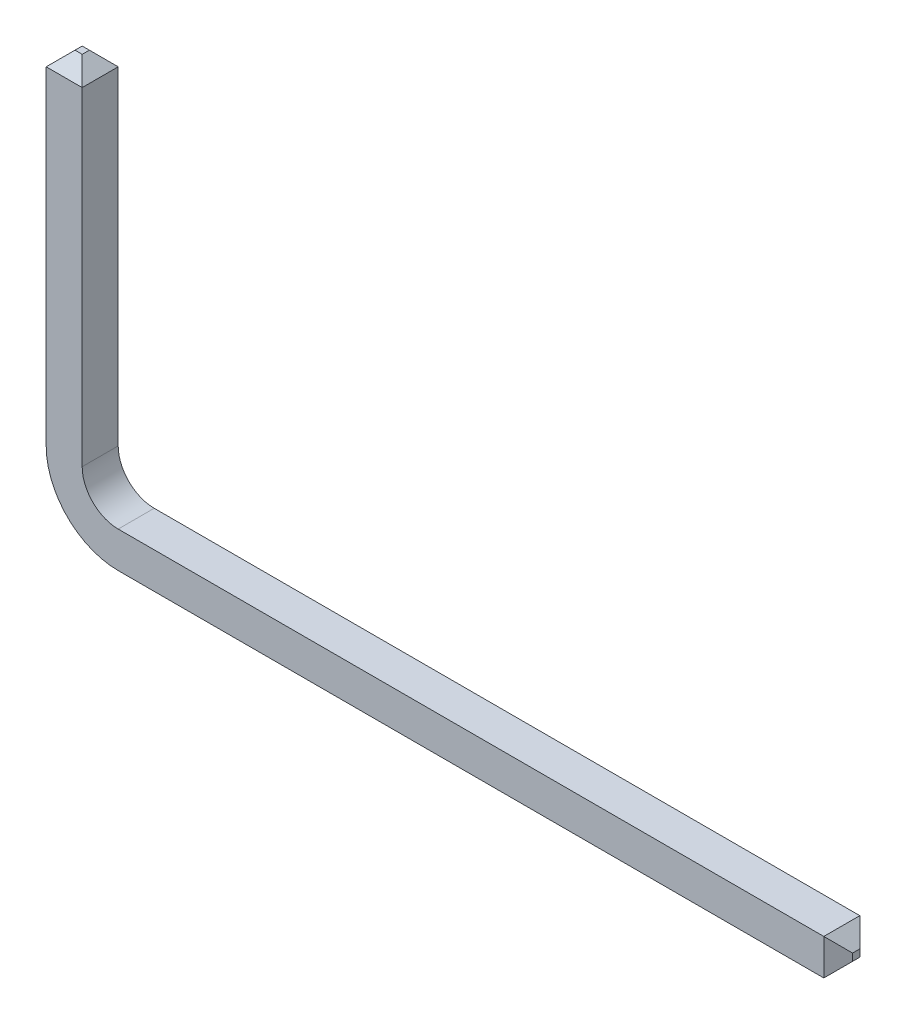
ISO-10303-21;
HEADER;
FILE_DESCRIPTION(('STEP AP214'),'2;1');
FILE_NAME('part.step','',(''),(''),'','','');
FILE_SCHEMA(('AUTOMOTIVE_DESIGN { 1 0 10303 214 1 1 1 1 }'));
ENDSEC;
DATA;
#1=APPLICATION_CONTEXT('core data for automotive mechanical design processes');
#2=APPLICATION_PROTOCOL_DEFINITION('international standard','automotive_design',2000,#1);
#3=PRODUCT_CONTEXT('',#1,'mechanical');
#4=PRODUCT('Part','Part','',(#3));
#5=PRODUCT_RELATED_PRODUCT_CATEGORY('part','',(#4));
#6=PRODUCT_DEFINITION_FORMATION('','',#4);
#7=PRODUCT_DEFINITION_CONTEXT('part definition',#1,'design');
#8=PRODUCT_DEFINITION('design','',#6,#7);
#9=PRODUCT_DEFINITION_SHAPE('','',#8);
#10=(LENGTH_UNIT() NAMED_UNIT(*) SI_UNIT(.MILLI.,.METRE.));
#11=(NAMED_UNIT(*) PLANE_ANGLE_UNIT() SI_UNIT($,.RADIAN.));
#12=(NAMED_UNIT(*) SI_UNIT($,.STERADIAN.) SOLID_ANGLE_UNIT());
#13=UNCERTAINTY_MEASURE_WITH_UNIT(LENGTH_MEASURE(1.E-05),#10,'distance_accuracy_value','');
#14=(GEOMETRIC_REPRESENTATION_CONTEXT(3) GLOBAL_UNCERTAINTY_ASSIGNED_CONTEXT((#13)) GLOBAL_UNIT_ASSIGNED_CONTEXT((#10,
#11,#12)) REPRESENTATION_CONTEXT('',''));
#15=CARTESIAN_POINT('',(0.,0.,0.));
#16=DIRECTION('',(0.,0.,1.));
#17=DIRECTION('',(1.,0.,0.));
#18=AXIS2_PLACEMENT_3D('',#15,#16,#17);
#19=CARTESIAN_POINT('',(1.45985415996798,2.96,0.1));
#20=DIRECTION('',(0.,0.707106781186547,-0.707106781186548));
#21=DIRECTION('',(0.,0.707106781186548,0.707106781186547));
#22=AXIS2_PLACEMENT_3D('',#19,#20,#21);
#23=PLANE('',#22);
#24=DIRECTION('',(1.,0.,0.));
#25=VECTOR('',#24,1.);
#26=CARTESIAN_POINT('',(-0.50414928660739,3.06,0.2));
#27=LINE('',#26,#25);
#28=CARTESIAN_POINT('',(-0.204149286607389,3.06,0.2));
#29=VERTEX_POINT('',#28);
#30=CARTESIAN_POINT('',(-0.30414928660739,3.06,0.2));
#31=VERTEX_POINT('',#30);
#32=EDGE_CURVE('E103',#29,#31,#27,.F.);
#33=ORIENTED_EDGE('',*,*,#32,.F.);
#34=DIRECTION('',(-0.577350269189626,0.577350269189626,0.577350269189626));
#35=VECTOR('',#34,1.);
#36=CARTESIAN_POINT('',(-0.00414928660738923,2.86,0.));
#37=LINE('',#36,#35);
#38=CARTESIAN_POINT('',(-0.00414928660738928,2.86,0.));
#39=VERTEX_POINT('',#38);
#40=EDGE_CURVE('E74',#39,#29,#37,.T.);
#41=ORIENTED_EDGE('',*,*,#40,.F.);
#42=DIRECTION('',(1.,0.,0.));
#43=VECTOR('',#42,1.);
#44=CARTESIAN_POINT('',(3.42385760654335,2.86,0.));
#45=LINE('',#44,#43);
#46=CARTESIAN_POINT('',(-0.504149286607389,2.86,0.));
#47=VERTEX_POINT('',#46);
#48=EDGE_CURVE('E203',#39,#47,#45,.F.);
#49=ORIENTED_EDGE('',*,*,#48,.T.);
#50=DIRECTION('',(-0.577350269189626,-0.577350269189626,-0.577350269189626));
#51=VECTOR('',#50,1.);
#52=CARTESIAN_POINT('',(-0.30414928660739,3.06,0.2));
#53=LINE('',#52,#51);
#54=EDGE_CURVE('E126',#31,#47,#53,.T.);
#55=ORIENTED_EDGE('',*,*,#54,.F.);
#56=EDGE_LOOP('',(#33,#41,#49,#55));
#57=FACE_BOUND('',#56,.T.);
#58=ADVANCED_FACE('F16',(#57),#23,.T.);
#59=CARTESIAN_POINT('',(10.3958507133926,-1.82164992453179,0.1));
#60=DIRECTION('',(0.707106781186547,0.,-0.707106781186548));
#61=DIRECTION('',(-0.707106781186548,0.,-0.707106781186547));
#62=AXIS2_PLACEMENT_3D('',#59,#60,#61);
#63=PLANE('',#62);
#64=DIRECTION('',(0.,1.,0.));
#65=VECTOR('',#64,1.);
#66=CARTESIAN_POINT('',(10.4958507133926,-2.2,0.2));
#67=LINE('',#66,#65);
#68=CARTESIAN_POINT('',(10.4958507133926,-2.5,0.2));
#69=VERTEX_POINT('',#68);
#70=CARTESIAN_POINT('',(10.4958507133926,-2.4,0.2));
#71=VERTEX_POINT('',#70);
#72=EDGE_CURVE('E94',#69,#71,#67,.T.);
#73=ORIENTED_EDGE('',*,*,#72,.F.);
#74=DIRECTION('',(0.577350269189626,0.577350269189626,0.577350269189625));
#75=VECTOR('',#74,1.);
#76=CARTESIAN_POINT('',(10.2958507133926,-2.7,0.));
#77=LINE('',#76,#75);
#78=CARTESIAN_POINT('',(10.2958507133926,-2.7,0.));
#79=VERTEX_POINT('',#78);
#80=EDGE_CURVE('E206',#79,#69,#77,.T.);
#81=ORIENTED_EDGE('',*,*,#80,.F.);
#82=DIRECTION('',(0.,1.,0.));
#83=VECTOR('',#82,1.);
#84=CARTESIAN_POINT('',(10.2958507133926,-1.44329984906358,0.));
#85=LINE('',#84,#83);
#86=CARTESIAN_POINT('',(10.2958507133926,-2.2,0.));
#87=VERTEX_POINT('',#86);
#88=EDGE_CURVE('E189',#79,#87,#85,.T.);
#89=ORIENTED_EDGE('',*,*,#88,.T.);
#90=DIRECTION('',(-0.577350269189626,0.577350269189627,-0.577350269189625));
#91=VECTOR('',#90,1.);
#92=CARTESIAN_POINT('',(10.4958507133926,-2.4,0.2));
#93=LINE('',#92,#91);
#94=EDGE_CURVE('E237',#71,#87,#93,.T.);
#95=ORIENTED_EDGE('',*,*,#94,.F.);
#96=EDGE_LOOP('',(#73,#81,#89,#95));
#97=FACE_BOUND('',#96,.T.);
#98=ADVANCED_FACE('F352',(#97),#63,.T.);
#99=CARTESIAN_POINT('',(10.4958507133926,-2.2,0.));
#100=DIRECTION('',(1.,0.,0.));
#101=DIRECTION('',(0.,0.,-1.));
#102=AXIS2_PLACEMENT_3D('',#99,#100,#101);
#103=PLANE('',#102);
#104=DIRECTION('',(0.,1.,0.));
#105=VECTOR('',#104,1.);
#106=CARTESIAN_POINT('',(10.4958507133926,-1.82164992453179,0.300000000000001));
#107=LINE('',#106,#105);
#108=CARTESIAN_POINT('',(10.4958507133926,-2.5,0.3));
#109=VERTEX_POINT('',#108);
#110=CARTESIAN_POINT('',(10.4958507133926,-2.4,0.3));
#111=VERTEX_POINT('',#110);
#112=EDGE_CURVE('E188',#109,#111,#107,.T.);
#113=ORIENTED_EDGE('',*,*,#112,.F.);
#114=DIRECTION('',(0.,0.,1.));
#115=VECTOR('',#114,1.);
#116=CARTESIAN_POINT('',(10.4958507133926,-2.5,0.));
#117=LINE('',#116,#115);
#118=EDGE_CURVE('E209',#69,#109,#117,.T.);
#119=ORIENTED_EDGE('',*,*,#118,.F.);
#120=ORIENTED_EDGE('',*,*,#72,.T.);
#121=DIRECTION('',(0.,0.,1.));
#122=VECTOR('',#121,1.);
#123=CARTESIAN_POINT('',(10.4958507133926,-2.4,0.));
#124=LINE('',#123,#122);
#125=EDGE_CURVE('E246',#111,#71,#124,.F.);
#126=ORIENTED_EDGE('',*,*,#125,.F.);
#127=EDGE_LOOP('',(#113,#119,#120,#126));
#128=FACE_BOUND('',#127,.T.);
#129=ADVANCED_FACE('F357',(#128),#103,.T.);
#130=CARTESIAN_POINT('',(10.3958507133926,-2.3,0.));
#131=DIRECTION('',(0.707106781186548,0.707106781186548,0.));
#132=DIRECTION('',(-0.707106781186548,0.707106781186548,0.));
#133=AXIS2_PLACEMENT_3D('',#130,#131,#132);
#134=PLANE('',#133);
#135=ORIENTED_EDGE('',*,*,#125,.T.);
#136=ORIENTED_EDGE('',*,*,#94,.T.);
#137=DIRECTION('',(0.,0.,1.));
#138=VECTOR('',#137,1.);
#139=CARTESIAN_POINT('',(10.2958507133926,-2.2,0.));
#140=LINE('',#139,#138);
#141=CARTESIAN_POINT('',(10.2958507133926,-2.2,0.5));
#142=VERTEX_POINT('',#141);
#143=EDGE_CURVE('E178',#142,#87,#140,.F.);
#144=ORIENTED_EDGE('',*,*,#143,.F.);
#145=DIRECTION('',(-0.577350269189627,0.577350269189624,0.577350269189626));
#146=VECTOR('',#145,1.);
#147=CARTESIAN_POINT('',(10.4958507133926,-2.4,0.300000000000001));
#148=LINE('',#147,#146);
#149=EDGE_CURVE('E182',#111,#142,#148,.T.);
#150=ORIENTED_EDGE('',*,*,#149,.F.);
#151=EDGE_LOOP('',(#135,#136,#144,#150));
#152=FACE_BOUND('',#151,.T.);
#153=ADVANCED_FACE('F316',(#152),#134,.T.);
#154=CARTESIAN_POINT('',(-0.104149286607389,2.96,0.));
#155=DIRECTION('',(0.707106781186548,0.707106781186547,0.));
#156=DIRECTION('',(-0.707106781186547,0.707106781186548,0.));
#157=AXIS2_PLACEMENT_3D('',#154,#155,#156);
#158=PLANE('',#157);
#159=DIRECTION('',(0.,0.,-1.));
#160=VECTOR('',#159,1.);
#161=CARTESIAN_POINT('',(-0.004149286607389,2.86,0.));
#162=LINE('',#161,#160);
#163=CARTESIAN_POINT('',(-0.00414928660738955,2.86,0.5));
#164=VERTEX_POINT('',#163);
#165=EDGE_CURVE('E171',#39,#164,#162,.F.);
#166=ORIENTED_EDGE('',*,*,#165,.F.);
#167=ORIENTED_EDGE('',*,*,#40,.T.);
#168=DIRECTION('',(0.,0.,1.));
#169=VECTOR('',#168,1.);
#170=CARTESIAN_POINT('',(-0.204149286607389,3.06,0.));
#171=LINE('',#170,#169);
#172=CARTESIAN_POINT('',(-0.204149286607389,3.06,0.3));
#173=VERTEX_POINT('',#172);
#174=EDGE_CURVE('E228',#173,#29,#171,.F.);
#175=ORIENTED_EDGE('',*,*,#174,.F.);
#176=DIRECTION('',(-0.577350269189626,0.577350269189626,-0.577350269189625));
#177=VECTOR('',#176,1.);
#178=CARTESIAN_POINT('',(-0.00414928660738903,2.86,0.5));
#179=LINE('',#178,#177);
#180=EDGE_CURVE('E163',#164,#173,#179,.T.);
#181=ORIENTED_EDGE('',*,*,#180,.F.);
#182=EDGE_LOOP('',(#166,#167,#175,#181));
#183=FACE_BOUND('',#182,.T.);
#184=ADVANCED_FACE('F303',(#183),#158,.T.);
#185=CARTESIAN_POINT('',(-0.50414928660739,3.06,0.));
#186=DIRECTION('',(0.,1.,0.));
#187=DIRECTION('',(0.,0.,1.));
#188=AXIS2_PLACEMENT_3D('',#185,#186,#187);
#189=PLANE('',#188);
#190=ORIENTED_EDGE('',*,*,#174,.T.);
#191=ORIENTED_EDGE('',*,*,#32,.T.);
#192=DIRECTION('',(0.,0.,1.));
#193=VECTOR('',#192,1.);
#194=CARTESIAN_POINT('',(-0.30414928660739,3.06,0.));
#195=LINE('',#194,#193);
#196=CARTESIAN_POINT('',(-0.30414928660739,3.06,0.3));
#197=VERTEX_POINT('',#196);
#198=EDGE_CURVE('E219',#197,#31,#195,.F.);
#199=ORIENTED_EDGE('',*,*,#198,.F.);
#200=DIRECTION('',(1.,0.,0.));
#201=VECTOR('',#200,1.);
#202=CARTESIAN_POINT('',(1.45985415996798,3.06,0.3));
#203=LINE('',#202,#201);
#204=EDGE_CURVE('E140',#173,#197,#203,.F.);
#205=ORIENTED_EDGE('',*,*,#204,.F.);
#206=EDGE_LOOP('',(#190,#191,#199,#205));
#207=FACE_BOUND('',#206,.T.);
#208=ADVANCED_FACE('F306',(#207),#189,.T.);
#209=CARTESIAN_POINT('',(-0.40414928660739,2.96,0.));
#210=DIRECTION('',(-0.707106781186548,0.707106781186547,0.));
#211=DIRECTION('',(-0.707106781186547,-0.707106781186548,0.));
#212=AXIS2_PLACEMENT_3D('',#209,#210,#211);
#213=PLANE('',#212);
#214=ORIENTED_EDGE('',*,*,#198,.T.);
#215=ORIENTED_EDGE('',*,*,#54,.T.);
#216=DIRECTION('',(0.,0.,1.));
#217=VECTOR('',#216,1.);
#218=CARTESIAN_POINT('',(-0.504149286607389,2.86,0.));
#219=LINE('',#218,#217);
#220=CARTESIAN_POINT('',(-0.50414928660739,2.86,0.5));
#221=VERTEX_POINT('',#220);
#222=EDGE_CURVE('E120',#221,#47,#219,.F.);
#223=ORIENTED_EDGE('',*,*,#222,.F.);
#224=DIRECTION('',(-0.577350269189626,-0.577350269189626,0.577350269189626));
#225=VECTOR('',#224,1.);
#226=CARTESIAN_POINT('',(-0.30414928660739,3.06,0.3));
#227=LINE('',#226,#225);
#228=EDGE_CURVE('E124',#197,#221,#227,.T.);
#229=ORIENTED_EDGE('',*,*,#228,.F.);
#230=EDGE_LOOP('',(#214,#215,#223,#229));
#231=FACE_BOUND('',#230,.T.);
#232=ADVANCED_FACE('F123',(#231),#213,.T.);
#233=CARTESIAN_POINT('',(10.3958507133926,-2.6,0.));
#234=DIRECTION('',(0.707106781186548,-0.707106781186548,0.));
#235=DIRECTION('',(0.707106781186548,0.707106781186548,0.));
#236=AXIS2_PLACEMENT_3D('',#233,#234,#235);
#237=PLANE('',#236);
#238=DIRECTION('',(0.,0.,-1.));
#239=VECTOR('',#238,1.);
#240=CARTESIAN_POINT('',(10.2958507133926,-2.7,0.));
#241=LINE('',#240,#239);
#242=CARTESIAN_POINT('',(10.2958507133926,-2.7,0.5));
#243=VERTEX_POINT('',#242);
#244=EDGE_CURVE('E269',#79,#243,#241,.F.);
#245=ORIENTED_EDGE('',*,*,#244,.F.);
#246=ORIENTED_EDGE('',*,*,#80,.T.);
#247=ORIENTED_EDGE('',*,*,#118,.T.);
#248=DIRECTION('',(0.577350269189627,0.577350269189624,-0.577350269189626));
#249=VECTOR('',#248,1.);
#250=CARTESIAN_POINT('',(10.2958507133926,-2.7,0.500000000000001));
#251=LINE('',#250,#249);
#252=EDGE_CURVE('E185',#243,#109,#251,.T.);
#253=ORIENTED_EDGE('',*,*,#252,.F.);
#254=EDGE_LOOP('',(#245,#246,#247,#253));
#255=FACE_BOUND('',#254,.T.);
#256=ADVANCED_FACE('F314',(#255),#237,.T.);
#257=CARTESIAN_POINT('',(3.42385760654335,-1.44329984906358,0.));
#258=DIRECTION('',(0.,0.,1.));
#259=DIRECTION('',(1.,0.,0.));
#260=AXIS2_PLACEMENT_3D('',#257,#258,#259);
#261=PLANE('',#260);
#262=DIRECTION('',(1.,0.,0.));
#263=VECTOR('',#262,1.);
#264=CARTESIAN_POINT('',(10.4958507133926,-2.7,0.));
#265=LINE('',#264,#263);
#266=CARTESIAN_POINT('',(0.495850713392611,-2.7,0.));
#267=VERTEX_POINT('',#266);
#268=EDGE_CURVE('E196',#267,#79,#265,.T.);
#269=ORIENTED_EDGE('',*,*,#268,.F.);
#270=CARTESIAN_POINT('',(0.495850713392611,-1.7,0.));
#271=DIRECTION('',(0.,0.,1.));
#272=DIRECTION('',(1.,0.,0.));
#273=AXIS2_PLACEMENT_3D('',#270,#271,#272);
#274=CIRCLE('',#273,1.);
#275=CARTESIAN_POINT('',(-0.504149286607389,-1.7,0.));
#276=VERTEX_POINT('',#275);
#277=EDGE_CURVE('E268',#276,#267,#274,.T.);
#278=ORIENTED_EDGE('',*,*,#277,.F.);
#279=DIRECTION('',(0.,1.,0.));
#280=VECTOR('',#279,1.);
#281=CARTESIAN_POINT('',(-0.504149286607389,-1.7,0.));
#282=LINE('',#281,#280);
#283=EDGE_CURVE('E130',#47,#276,#282,.F.);
#284=ORIENTED_EDGE('',*,*,#283,.F.);
#285=ORIENTED_EDGE('',*,*,#48,.F.);
#286=DIRECTION('',(0.,1.,0.));
#287=VECTOR('',#286,1.);
#288=CARTESIAN_POINT('',(-0.004149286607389,3.06,0.));
#289=LINE('',#288,#287);
#290=CARTESIAN_POINT('',(-0.00414928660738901,-1.7,0.));
#291=VERTEX_POINT('',#290);
#292=EDGE_CURVE('E165',#291,#39,#289,.T.);
#293=ORIENTED_EDGE('',*,*,#292,.F.);
#294=CARTESIAN_POINT('',(0.495850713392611,-1.7,0.));
#295=DIRECTION('',(0.,0.,1.));
#296=DIRECTION('',(1.,0.,0.));
#297=AXIS2_PLACEMENT_3D('',#294,#295,#296);
#298=CIRCLE('',#297,0.5);
#299=CARTESIAN_POINT('',(0.495850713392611,-2.2,0.));
#300=VERTEX_POINT('',#299);
#301=EDGE_CURVE('E20',#291,#300,#298,.T.);
#302=ORIENTED_EDGE('',*,*,#301,.T.);
#303=DIRECTION('',(1.,0.,0.));
#304=VECTOR('',#303,1.);
#305=CARTESIAN_POINT('',(0.495850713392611,-2.2,0.));
#306=LINE('',#305,#304);
#307=EDGE_CURVE('E181',#87,#300,#306,.F.);
#308=ORIENTED_EDGE('',*,*,#307,.F.);
#309=ORIENTED_EDGE('',*,*,#88,.F.);
#310=EDGE_LOOP('',(#269,#278,#284,#285,#293,#302,#308,#309));
#311=FACE_BOUND('',#310,.T.);
#312=ADVANCED_FACE('F305',(#311),#261,.F.);
#313=CARTESIAN_POINT('',(10.3958507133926,-1.82164992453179,0.4));
#314=DIRECTION('',(0.707106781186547,0.,0.707106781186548));
#315=DIRECTION('',(0.707106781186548,0.,-0.707106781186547));
#316=AXIS2_PLACEMENT_3D('',#313,#314,#315);
#317=PLANE('',#316);
#318=ORIENTED_EDGE('',*,*,#112,.T.);
#319=ORIENTED_EDGE('',*,*,#149,.T.);
#320=DIRECTION('',(0.,1.,0.));
#321=VECTOR('',#320,1.);
#322=CARTESIAN_POINT('',(10.2958507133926,-1.44329984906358,0.5));
#323=LINE('',#322,#321);
#324=EDGE_CURVE('E199',#243,#142,#323,.T.);
#325=ORIENTED_EDGE('',*,*,#324,.F.);
#326=ORIENTED_EDGE('',*,*,#252,.T.);
#327=EDGE_LOOP('',(#318,#319,#325,#326));
#328=FACE_BOUND('',#327,.T.);
#329=ADVANCED_FACE('F340',(#328),#317,.T.);
#330=CARTESIAN_POINT('',(0.495850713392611,-2.2,0.));
#331=DIRECTION('',(0.,1.,0.));
#332=DIRECTION('',(0.,0.,1.));
#333=AXIS2_PLACEMENT_3D('',#330,#331,#332);
#334=PLANE('',#333);
#335=DIRECTION('',(0.,0.,1.));
#336=VECTOR('',#335,1.);
#337=CARTESIAN_POINT('',(0.495850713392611,-2.2,0.));
#338=LINE('',#337,#336);
#339=CARTESIAN_POINT('',(0.495850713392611,-2.2,0.5));
#340=VERTEX_POINT('',#339);
#341=EDGE_CURVE('E174',#300,#340,#338,.T.);
#342=ORIENTED_EDGE('',*,*,#341,.T.);
#343=DIRECTION('',(1.,0.,0.));
#344=VECTOR('',#343,1.);
#345=CARTESIAN_POINT('',(3.42385760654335,-2.2,0.5));
#346=LINE('',#345,#344);
#347=EDGE_CURVE('E267',#142,#340,#346,.F.);
#348=ORIENTED_EDGE('',*,*,#347,.F.);
#349=ORIENTED_EDGE('',*,*,#143,.T.);
#350=ORIENTED_EDGE('',*,*,#307,.T.);
#351=EDGE_LOOP('',(#342,#348,#349,#350));
#352=FACE_BOUND('',#351,.T.);
#353=ADVANCED_FACE('F296',(#352),#334,.T.);
#354=CARTESIAN_POINT('',(0.495850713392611,-1.7,0.));
#355=DIRECTION('',(0.,0.,1.));
#356=DIRECTION('',(1.,0.,0.));
#357=AXIS2_PLACEMENT_3D('',#354,#355,#356);
#358=CYLINDRICAL_SURFACE('',#357,0.5);
#359=ORIENTED_EDGE('',*,*,#341,.F.);
#360=ORIENTED_EDGE('',*,*,#301,.F.);
#361=DIRECTION('',(0.,0.,-1.));
#362=VECTOR('',#361,1.);
#363=CARTESIAN_POINT('',(-0.004149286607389,-1.7,0.));
#364=LINE('',#363,#362);
#365=CARTESIAN_POINT('',(-0.00414928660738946,-1.7,0.5));
#366=VERTEX_POINT('',#365);
#367=EDGE_CURVE('E168',#366,#291,#364,.T.);
#368=ORIENTED_EDGE('',*,*,#367,.F.);
#369=CARTESIAN_POINT('',(0.495850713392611,-1.7,0.5));
#370=DIRECTION('',(0.,0.,1.));
#371=DIRECTION('',(1.,0.,0.));
#372=AXIS2_PLACEMENT_3D('',#369,#370,#371);
#373=CIRCLE('',#372,0.5);
#374=EDGE_CURVE('E154',#340,#366,#373,.F.);
#375=ORIENTED_EDGE('',*,*,#374,.F.);
#376=EDGE_LOOP('',(#359,#360,#368,#375));
#377=FACE_BOUND('',#376,.T.);
#378=ADVANCED_FACE('F298',(#377),#358,.F.);
#379=CARTESIAN_POINT('',(-0.004149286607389,3.06,0.));
#380=DIRECTION('',(1.,0.,0.));
#381=DIRECTION('',(0.,0.,-1.));
#382=AXIS2_PLACEMENT_3D('',#379,#380,#381);
#383=PLANE('',#382);
#384=ORIENTED_EDGE('',*,*,#367,.T.);
#385=ORIENTED_EDGE('',*,*,#292,.T.);
#386=ORIENTED_EDGE('',*,*,#165,.T.);
#387=DIRECTION('',(0.,1.,0.));
#388=VECTOR('',#387,1.);
#389=CARTESIAN_POINT('',(-0.0041492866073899,-1.44329984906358,0.5));
#390=LINE('',#389,#388);
#391=EDGE_CURVE('E152',#366,#164,#390,.T.);
#392=ORIENTED_EDGE('',*,*,#391,.F.);
#393=EDGE_LOOP('',(#384,#385,#386,#392));
#394=FACE_BOUND('',#393,.T.);
#395=ADVANCED_FACE('F300',(#394),#383,.T.);
#396=CARTESIAN_POINT('',(1.45985415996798,2.96,0.4));
#397=DIRECTION('',(0.,0.707106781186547,0.707106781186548));
#398=DIRECTION('',(0.,-0.707106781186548,0.707106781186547));
#399=AXIS2_PLACEMENT_3D('',#396,#397,#398);
#400=PLANE('',#399);
#401=ORIENTED_EDGE('',*,*,#204,.T.);
#402=ORIENTED_EDGE('',*,*,#228,.T.);
#403=DIRECTION('',(1.,0.,0.));
#404=VECTOR('',#403,1.);
#405=CARTESIAN_POINT('',(3.42385760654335,2.86,0.5));
#406=LINE('',#405,#404);
#407=EDGE_CURVE('E137',#164,#221,#406,.F.);
#408=ORIENTED_EDGE('',*,*,#407,.F.);
#409=ORIENTED_EDGE('',*,*,#180,.T.);
#410=EDGE_LOOP('',(#401,#402,#408,#409));
#411=FACE_BOUND('',#410,.T.);
#412=ADVANCED_FACE('F134',(#411),#400,.T.);
#413=CARTESIAN_POINT('',(-0.504149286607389,-1.7,0.));
#414=DIRECTION('',(-1.,0.,0.));
#415=DIRECTION('',(0.,0.,1.));
#416=AXIS2_PLACEMENT_3D('',#413,#414,#415);
#417=PLANE('',#416);
#418=DIRECTION('',(0.,0.,1.));
#419=VECTOR('',#418,1.);
#420=CARTESIAN_POINT('',(-0.504149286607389,-1.7,0.));
#421=LINE('',#420,#419);
#422=CARTESIAN_POINT('',(-0.504149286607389,-1.7,0.5));
#423=VERTEX_POINT('',#422);
#424=EDGE_CURVE('E146',#423,#276,#421,.F.);
#425=ORIENTED_EDGE('',*,*,#424,.F.);
#426=DIRECTION('',(0.,1.,0.));
#427=VECTOR('',#426,1.);
#428=CARTESIAN_POINT('',(-0.50414928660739,-1.44329984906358,0.5));
#429=LINE('',#428,#427);
#430=EDGE_CURVE('E143',#221,#423,#429,.F.);
#431=ORIENTED_EDGE('',*,*,#430,.F.);
#432=ORIENTED_EDGE('',*,*,#222,.T.);
#433=ORIENTED_EDGE('',*,*,#283,.T.);
#434=EDGE_LOOP('',(#425,#431,#432,#433));
#435=FACE_BOUND('',#434,.T.);
#436=ADVANCED_FACE('F144',(#435),#417,.T.);
#437=CARTESIAN_POINT('',(0.495850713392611,-1.7,0.));
#438=DIRECTION('',(0.,0.,1.));
#439=DIRECTION('',(1.,0.,0.));
#440=AXIS2_PLACEMENT_3D('',#437,#438,#439);
#441=CYLINDRICAL_SURFACE('',#440,1.);
#442=ORIENTED_EDGE('',*,*,#277,.T.);
#443=DIRECTION('',(0.,0.,-1.));
#444=VECTOR('',#443,1.);
#445=CARTESIAN_POINT('',(0.495850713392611,-2.7,0.));
#446=LINE('',#445,#444);
#447=CARTESIAN_POINT('',(0.495850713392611,-2.7,0.5));
#448=VERTEX_POINT('',#447);
#449=EDGE_CURVE('E35',#448,#267,#446,.T.);
#450=ORIENTED_EDGE('',*,*,#449,.F.);
#451=CARTESIAN_POINT('',(0.495850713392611,-1.7,0.5));
#452=DIRECTION('',(0.,0.,1.));
#453=DIRECTION('',(1.,0.,0.));
#454=AXIS2_PLACEMENT_3D('',#451,#452,#453);
#455=CIRCLE('',#454,1.);
#456=EDGE_CURVE('E26',#423,#448,#455,.T.);
#457=ORIENTED_EDGE('',*,*,#456,.F.);
#458=ORIENTED_EDGE('',*,*,#424,.T.);
#459=EDGE_LOOP('',(#442,#450,#457,#458));
#460=FACE_BOUND('',#459,.T.);
#461=ADVANCED_FACE('F323',(#460),#441,.T.);
#462=CARTESIAN_POINT('',(10.4958507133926,-2.7,0.));
#463=DIRECTION('',(0.,-1.,0.));
#464=DIRECTION('',(0.,0.,-1.));
#465=AXIS2_PLACEMENT_3D('',#462,#463,#464);
#466=PLANE('',#465);
#467=ORIENTED_EDGE('',*,*,#449,.T.);
#468=ORIENTED_EDGE('',*,*,#268,.T.);
#469=ORIENTED_EDGE('',*,*,#244,.T.);
#470=DIRECTION('',(1.,0.,0.));
#471=VECTOR('',#470,1.);
#472=CARTESIAN_POINT('',(3.42385760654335,-2.7,0.5));
#473=LINE('',#472,#471);
#474=EDGE_CURVE('E11',#448,#243,#473,.T.);
#475=ORIENTED_EDGE('',*,*,#474,.F.);
#476=EDGE_LOOP('',(#467,#468,#469,#475));
#477=FACE_BOUND('',#476,.T.);
#478=ADVANCED_FACE('F319',(#477),#466,.T.);
#479=CARTESIAN_POINT('',(3.42385760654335,-1.44329984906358,0.5));
#480=DIRECTION('',(0.,0.,1.));
#481=DIRECTION('',(1.,0.,0.));
#482=AXIS2_PLACEMENT_3D('',#479,#480,#481);
#483=PLANE('',#482);
#484=ORIENTED_EDGE('',*,*,#456,.T.);
#485=ORIENTED_EDGE('',*,*,#474,.T.);
#486=ORIENTED_EDGE('',*,*,#324,.T.);
#487=ORIENTED_EDGE('',*,*,#347,.T.);
#488=ORIENTED_EDGE('',*,*,#374,.T.);
#489=ORIENTED_EDGE('',*,*,#391,.T.);
#490=ORIENTED_EDGE('',*,*,#407,.T.);
#491=ORIENTED_EDGE('',*,*,#430,.T.);
#492=EDGE_LOOP('',(#484,#485,#486,#487,#488,#489,#490,#491));
#493=FACE_BOUND('',#492,.T.);
#494=ADVANCED_FACE('F18',(#493),#483,.T.);
#495=CLOSED_SHELL('',(#58,#98,#129,#153,#184,#208,#232,#256,#312,#329,#353,#378,#395,#412,#436,
#461,#478,#494));
#496=MANIFOLD_SOLID_BREP('B1',#495);
#497=ADVANCED_BREP_SHAPE_REPRESENTATION('',(#18,#496),#14);
#498=SHAPE_DEFINITION_REPRESENTATION(#9,#497);
ENDSEC;
END-ISO-10303-21;
